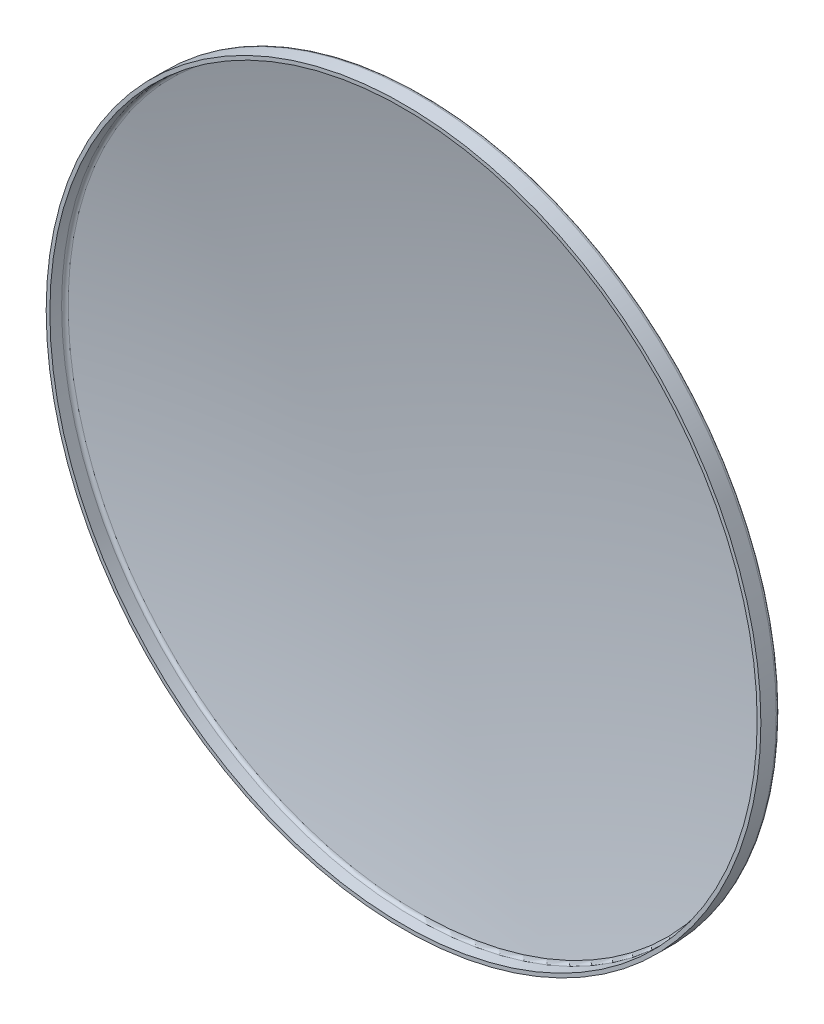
ISO-10303-21;
HEADER;
FILE_DESCRIPTION(('STEP AP214'),'2;1');
FILE_NAME('part.step','',(''),(''),'','','');
FILE_SCHEMA(('AUTOMOTIVE_DESIGN { 1 0 10303 214 1 1 1 1 }'));
ENDSEC;
DATA;
#1=APPLICATION_CONTEXT('core data for automotive mechanical design processes');
#2=APPLICATION_PROTOCOL_DEFINITION('international standard','automotive_design',2000,#1);
#3=PRODUCT_CONTEXT('',#1,'mechanical');
#4=PRODUCT('Part','Part','',(#3));
#5=PRODUCT_RELATED_PRODUCT_CATEGORY('part','',(#4));
#6=PRODUCT_DEFINITION_FORMATION('','',#4);
#7=PRODUCT_DEFINITION_CONTEXT('part definition',#1,'design');
#8=PRODUCT_DEFINITION('design','',#6,#7);
#9=PRODUCT_DEFINITION_SHAPE('','',#8);
#10=(LENGTH_UNIT() NAMED_UNIT(*) SI_UNIT(.MILLI.,.METRE.));
#11=(NAMED_UNIT(*) PLANE_ANGLE_UNIT() SI_UNIT($,.RADIAN.));
#12=(NAMED_UNIT(*) SI_UNIT($,.STERADIAN.) SOLID_ANGLE_UNIT());
#13=UNCERTAINTY_MEASURE_WITH_UNIT(LENGTH_MEASURE(1.E-05),#10,'distance_accuracy_value','');
#14=(GEOMETRIC_REPRESENTATION_CONTEXT(3) GLOBAL_UNCERTAINTY_ASSIGNED_CONTEXT((#13)) GLOBAL_UNIT_ASSIGNED_CONTEXT((#10,
#11,#12)) REPRESENTATION_CONTEXT('',''));
#15=CARTESIAN_POINT('',(0.,0.,0.));
#16=DIRECTION('',(0.,0.,1.));
#17=DIRECTION('',(1.,0.,0.));
#18=AXIS2_PLACEMENT_3D('',#15,#16,#17);
#19=CARTESIAN_POINT('',(457.2,0.,0.));
#20=DIRECTION('',(0.,0.,1.));
#21=DIRECTION('',(1.,0.,0.));
#22=AXIS2_PLACEMENT_3D('',#19,#20,#21);
#23=PLANE('',#22);
#24=CARTESIAN_POINT('',(0.,0.,0.));
#25=DIRECTION('',(0.,0.,1.));
#26=DIRECTION('',(1.,0.,0.));
#27=AXIS2_PLACEMENT_3D('',#24,#25,#26);
#28=CIRCLE('',#27,461.9625);
#29=CARTESIAN_POINT('',(461.9625,0.,0.));
#30=VERTEX_POINT('',#29);
#31=EDGE_CURVE('E11',#30,#30,#28,.T.);
#32=ORIENTED_EDGE('',*,*,#31,.T.);
#33=EDGE_LOOP('',(#32));
#34=FACE_BOUND('',#33,.T.);
#35=CARTESIAN_POINT('',(0.,0.,0.));
#36=DIRECTION('',(0.,0.,1.));
#37=DIRECTION('',(1.,0.,0.));
#38=AXIS2_PLACEMENT_3D('',#35,#36,#37);
#39=CIRCLE('',#38,457.2);
#40=CARTESIAN_POINT('',(457.2,0.,0.));
#41=VERTEX_POINT('',#40);
#42=EDGE_CURVE('E62',#41,#41,#39,.T.);
#43=ORIENTED_EDGE('',*,*,#42,.F.);
#44=EDGE_LOOP('',(#43));
#45=FACE_BOUND('',#44,.T.);
#46=ADVANCED_FACE('F34',(#34,#45),#23,.T.);
#47=CARTESIAN_POINT('',(0.,0.,0.));
#48=DIRECTION('',(0.,0.,1.));
#49=DIRECTION('',(1.,0.,0.));
#50=AXIS2_PLACEMENT_3D('',#47,#48,#49);
#51=CYLINDRICAL_SURFACE('',#50,461.9625);
#52=CARTESIAN_POINT('',(0.,0.,-19.9443818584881));
#53=DIRECTION('',(0.,0.,1.));
#54=DIRECTION('',(1.,0.,0.));
#55=AXIS2_PLACEMENT_3D('',#52,#53,#54);
#56=CIRCLE('',#55,461.9625);
#57=CARTESIAN_POINT('',(461.9625,0.,-19.9443818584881));
#58=VERTEX_POINT('',#57);
#59=EDGE_CURVE('E40',#58,#58,#56,.T.);
#60=ORIENTED_EDGE('',*,*,#59,.T.);
#61=EDGE_LOOP('',(#60));
#62=FACE_BOUND('',#61,.T.);
#63=ORIENTED_EDGE('',*,*,#31,.F.);
#64=EDGE_LOOP('',(#63));
#65=FACE_BOUND('',#64,.T.);
#66=ADVANCED_FACE('F70',(#62,#65),#51,.T.);
#67=CARTESIAN_POINT('',(0.,0.,-19.9443818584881));
#68=DIRECTION('',(0.,0.,1.));
#69=DIRECTION('',(1.,0.,0.));
#70=AXIS2_PLACEMENT_3D('',#67,#68,#69);
#71=TOROIDAL_SURFACE('',#70,457.2,4.76249999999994);
#72=CARTESIAN_POINT('',(0.,0.,-24.6065294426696));
#73=DIRECTION('',(0.,0.,1.));
#74=DIRECTION('',(1.,0.,0.));
#75=AXIS2_PLACEMENT_3D('',#72,#73,#74);
#76=CIRCLE('',#75,458.172515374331);
#77=CARTESIAN_POINT('',(458.172515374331,0.,-24.6065294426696));
#78=VERTEX_POINT('',#77);
#79=EDGE_CURVE('E51',#78,#78,#76,.T.);
#80=ORIENTED_EDGE('',*,*,#79,.T.);
#81=EDGE_LOOP('',(#80));
#82=FACE_BOUND('',#81,.T.);
#83=ORIENTED_EDGE('',*,*,#59,.F.);
#84=EDGE_LOOP('',(#83));
#85=FACE_BOUND('',#84,.T.);
#86=ADVANCED_FACE('F47',(#82,#85),#71,.T.);
#87=CARTESIAN_POINT('',(4.2933432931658,0.,2151.24769505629));
#88=DIRECTION('',(0.,-1.,0.));
#89=DIRECTION('',(1.,0.,0.));
#90=AXIS2_PLACEMENT_3D('',#87,#88,#89);
#91=CIRCLE('',#90,2222.68934156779);
#92=TRIMMED_CURVE('',#91,(PARAMETER_VALUE(-1.57272792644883)),
(PARAMETER_VALUE(1.57272792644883)),.T.,.PARAMETER.);
#93=CARTESIAN_POINT('',(0.,0.,2151.24769505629));
#94=DIRECTION('',(0.,0.,1.));
#95=AXIS1_PLACEMENT('',#93,#94);
#96=SURFACE_OF_REVOLUTION('',#92,#95);
#97=CARTESIAN_POINT('',(-5.31692745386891E-13,0.,-71.4375000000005));
#98=VERTEX_POINT('',#97);
#99=VERTEX_LOOP('',#98);
#100=FACE_BOUND('',#99,.T.);
#101=ORIENTED_EDGE('',*,*,#79,.F.);
#102=EDGE_LOOP('',(#101));
#103=FACE_BOUND('',#102,.T.);
#104=ADVANCED_FACE('F43',(#100,#103),#96,.T.);
#105=CARTESIAN_POINT('',(0.,0.,2151.6975));
#106=DIRECTION('',(0.,0.,1.));
#107=DIRECTION('',(1.,0.,0.));
#108=AXIS2_PLACEMENT_3D('',#105,#106,#107);
#109=SPHERICAL_SURFACE('',#108,2218.3725);
#110=CARTESIAN_POINT('',(0.,0.,-19.8446023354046));
#111=DIRECTION('',(0.,0.,1.));
#112=DIRECTION('',(1.,0.,0.));
#113=AXIS2_PLACEMENT_3D('',#110,#111,#112);
#114=CIRCLE('',#113,453.410902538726);
#115=CARTESIAN_POINT('',(453.410902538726,0.,-19.8446023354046));
#116=VERTEX_POINT('',#115);
#117=EDGE_CURVE('E53',#116,#116,#114,.T.);
#118=ORIENTED_EDGE('',*,*,#117,.T.);
#119=EDGE_LOOP('',(#118));
#120=FACE_BOUND('',#119,.T.);
#121=ADVANCED_FACE('F46',(#120),#109,.F.);
#122=CARTESIAN_POINT('',(0.,0.,-15.1826399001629));
#123=DIRECTION('',(0.,0.,1.));
#124=DIRECTION('',(1.,0.,0.));
#125=AXIS2_PLACEMENT_3D('',#122,#123,#124);
#126=TOROIDAL_SURFACE('',#125,452.4375,4.76249999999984);
#127=CARTESIAN_POINT('',(0.,0.,-15.1826399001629));
#128=DIRECTION('',(0.,0.,1.));
#129=DIRECTION('',(1.,0.,0.));
#130=AXIS2_PLACEMENT_3D('',#127,#128,#129);
#131=CIRCLE('',#130,457.2);
#132=CARTESIAN_POINT('',(457.2,0.,-15.1826399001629));
#133=VERTEX_POINT('',#132);
#134=EDGE_CURVE('E57',#133,#133,#131,.T.);
#135=ORIENTED_EDGE('',*,*,#134,.T.);
#136=EDGE_LOOP('',(#135));
#137=FACE_BOUND('',#136,.T.);
#138=ORIENTED_EDGE('',*,*,#117,.F.);
#139=EDGE_LOOP('',(#138));
#140=FACE_BOUND('',#139,.T.);
#141=ADVANCED_FACE('F85',(#137,#140),#126,.F.);
#142=CARTESIAN_POINT('',(0.,0.,0.));
#143=DIRECTION('',(0.,0.,1.));
#144=DIRECTION('',(1.,0.,0.));
#145=AXIS2_PLACEMENT_3D('',#142,#143,#144);
#146=CYLINDRICAL_SURFACE('',#145,457.2);
#147=ORIENTED_EDGE('',*,*,#42,.T.);
#148=EDGE_LOOP('',(#147));
#149=FACE_BOUND('',#148,.T.);
#150=ORIENTED_EDGE('',*,*,#134,.F.);
#151=EDGE_LOOP('',(#150));
#152=FACE_BOUND('',#151,.T.);
#153=ADVANCED_FACE('F66',(#149,#152),#146,.F.);
#154=CLOSED_SHELL('',(#46,#66,#86,#104,#121,#141,#153));
#155=MANIFOLD_SOLID_BREP('B2',#154);
#156=ADVANCED_BREP_SHAPE_REPRESENTATION('',(#18,#155),#14);
#157=SHAPE_DEFINITION_REPRESENTATION(#9,#156);
ENDSEC;
END-ISO-10303-21;
